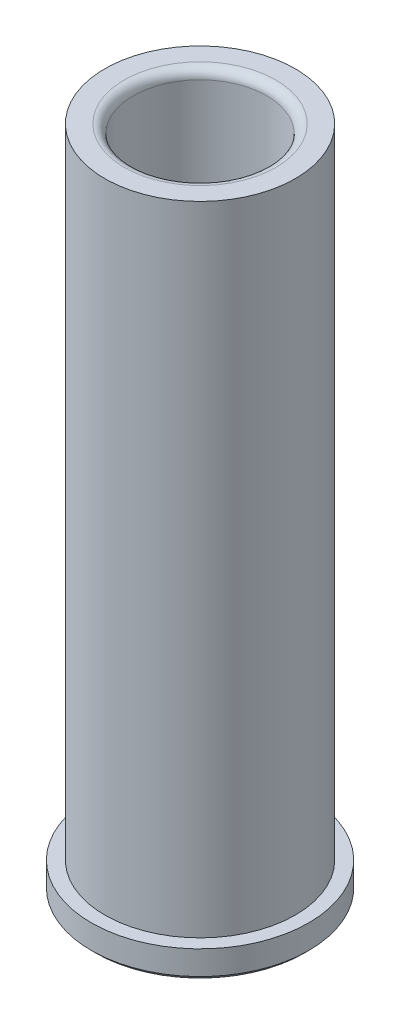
ISO-10303-21;
HEADER;
FILE_DESCRIPTION(('STEP AP214'),'2;1');
FILE_NAME('part.step','',(''),(''),'','','');
FILE_SCHEMA(('AUTOMOTIVE_DESIGN { 1 0 10303 214 1 1 1 1 }'));
ENDSEC;
DATA;
#1=APPLICATION_CONTEXT('core data for automotive mechanical design processes');
#2=APPLICATION_PROTOCOL_DEFINITION('international standard','automotive_design',2000,#1);
#3=PRODUCT_CONTEXT('',#1,'mechanical');
#4=PRODUCT('Part','Part','',(#3));
#5=PRODUCT_RELATED_PRODUCT_CATEGORY('part','',(#4));
#6=PRODUCT_DEFINITION_FORMATION('','',#4);
#7=PRODUCT_DEFINITION_CONTEXT('part definition',#1,'design');
#8=PRODUCT_DEFINITION('design','',#6,#7);
#9=PRODUCT_DEFINITION_SHAPE('','',#8);
#10=(LENGTH_UNIT() NAMED_UNIT(*) SI_UNIT(.MILLI.,.METRE.));
#11=(NAMED_UNIT(*) PLANE_ANGLE_UNIT() SI_UNIT($,.RADIAN.));
#12=(NAMED_UNIT(*) SI_UNIT($,.STERADIAN.) SOLID_ANGLE_UNIT());
#13=UNCERTAINTY_MEASURE_WITH_UNIT(LENGTH_MEASURE(1.E-05),#10,'distance_accuracy_value','');
#14=(GEOMETRIC_REPRESENTATION_CONTEXT(3) GLOBAL_UNCERTAINTY_ASSIGNED_CONTEXT((#13)) GLOBAL_UNIT_ASSIGNED_CONTEXT((#10,
#11,#12)) REPRESENTATION_CONTEXT('',''));
#15=CARTESIAN_POINT('',(0.,0.,0.));
#16=DIRECTION('',(0.,0.,1.));
#17=DIRECTION('',(1.,0.,0.));
#18=AXIS2_PLACEMENT_3D('',#15,#16,#17);
#19=CARTESIAN_POINT('',(3.49148336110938E-12,-1000.,0.));
#20=DIRECTION('',(0.,-1.,0.));
#21=DIRECTION('',(1.,0.,0.));
#22=AXIS2_PLACEMENT_3D('',#19,#20,#21);
#23=CYLINDRICAL_SURFACE('',#22,15.8813499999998);
#24=CARTESIAN_POINT('',(0.,4.7625,0.));
#25=DIRECTION('',(0.,-1.,0.));
#26=DIRECTION('',(1.,0.,0.));
#27=AXIS2_PLACEMENT_3D('',#24,#25,#26);
#28=CIRCLE('',#27,15.88135);
#29=CARTESIAN_POINT('',(15.8813499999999,4.76250000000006,0.));
#30=VERTEX_POINT('',#29);
#31=EDGE_CURVE('E60',#30,#30,#28,.T.);
#32=ORIENTED_EDGE('',*,*,#31,.F.);
#33=EDGE_LOOP('',(#32));
#34=FACE_BOUND('',#33,.T.);
#35=CARTESIAN_POINT('',(-3.8799108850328E-13,111.125,0.));
#36=DIRECTION('',(0.,-1.,0.));
#37=DIRECTION('',(1.,0.,0.));
#38=AXIS2_PLACEMENT_3D('',#35,#36,#37);
#39=CIRCLE('',#38,15.8813499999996);
#40=CARTESIAN_POINT('',(15.8813499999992,111.125,0.));
#41=VERTEX_POINT('',#40);
#42=EDGE_CURVE('E39',#41,#41,#39,.T.);
#43=ORIENTED_EDGE('',*,*,#42,.T.);
#44=EDGE_LOOP('',(#43));
#45=FACE_BOUND('',#44,.T.);
#46=ADVANCED_FACE('F28',(#34,#45),#23,.T.);
#47=CARTESIAN_POINT('',(-15.88135,111.125,0.));
#48=DIRECTION('',(0.,-1.,0.));
#49=DIRECTION('',(1.,0.,0.));
#50=AXIS2_PLACEMENT_3D('',#47,#48,#49);
#51=PLANE('',#50);
#52=CARTESIAN_POINT('',(-3.8799108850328E-13,111.125,0.));
#53=DIRECTION('',(0.,-1.,0.));
#54=DIRECTION('',(1.,0.,0.));
#55=AXIS2_PLACEMENT_3D('',#52,#53,#54);
#56=CIRCLE('',#55,12.6428499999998);
#57=CARTESIAN_POINT('',(12.6428499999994,111.125,0.));
#58=VERTEX_POINT('',#57);
#59=EDGE_CURVE('E35',#58,#58,#56,.T.);
#60=ORIENTED_EDGE('',*,*,#59,.T.);
#61=EDGE_LOOP('',(#60));
#62=FACE_BOUND('',#61,.T.);
#63=ORIENTED_EDGE('',*,*,#42,.F.);
#64=EDGE_LOOP('',(#63));
#65=FACE_BOUND('',#64,.T.);
#66=ADVANCED_FACE('F68',(#62,#65),#51,.F.);
#67=CARTESIAN_POINT('',(3.49148336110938E-12,-1000.,0.));
#68=DIRECTION('',(0.,-1.,0.));
#69=DIRECTION('',(1.,0.,0.));
#70=AXIS2_PLACEMENT_3D('',#67,#68,#69);
#71=CYLINDRICAL_SURFACE('',#70,11.1188499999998);
#72=CARTESIAN_POINT('',(-3.8267006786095E-13,109.601,0.));
#73=DIRECTION('',(0.,-1.,0.));
#74=DIRECTION('',(1.,0.,0.));
#75=AXIS2_PLACEMENT_3D('',#72,#73,#74);
#76=CIRCLE('',#75,11.1188499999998);
#77=CARTESIAN_POINT('',(11.1188499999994,109.601,0.));
#78=VERTEX_POINT('',#77);
#79=EDGE_CURVE('E10',#78,#78,#76,.F.);
#80=ORIENTED_EDGE('',*,*,#79,.T.);
#81=EDGE_LOOP('',(#80));
#82=FACE_BOUND('',#81,.T.);
#83=CARTESIAN_POINT('',(0.,0.761999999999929,0.));
#84=DIRECTION('',(0.,-1.,0.));
#85=DIRECTION('',(1.,0.,0.));
#86=AXIS2_PLACEMENT_3D('',#83,#84,#85);
#87=CIRCLE('',#86,11.11885);
#88=CARTESIAN_POINT('',(11.11885,0.761999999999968,0.));
#89=VERTEX_POINT('',#88);
#90=EDGE_CURVE('E43',#89,#89,#87,.T.);
#91=ORIENTED_EDGE('',*,*,#90,.T.);
#92=EDGE_LOOP('',(#91));
#93=FACE_BOUND('',#92,.T.);
#94=ADVANCED_FACE('F72',(#82,#93),#71,.F.);
#95=CARTESIAN_POINT('',(0.,0.,0.));
#96=DIRECTION('',(0.,-1.,0.));
#97=DIRECTION('',(1.,0.,0.));
#98=AXIS2_PLACEMENT_3D('',#95,#96,#97);
#99=CONICAL_SURFACE('',#98,11.88085,0.785398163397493);
#100=ORIENTED_EDGE('',*,*,#90,.F.);
#101=EDGE_LOOP('',(#100));
#102=FACE_BOUND('',#101,.T.);
#103=CARTESIAN_POINT('',(0.,0.,0.));
#104=DIRECTION('',(0.,-1.,0.));
#105=DIRECTION('',(1.,0.,0.));
#106=AXIS2_PLACEMENT_3D('',#103,#104,#105);
#107=CIRCLE('',#106,11.88085);
#108=CARTESIAN_POINT('',(11.88085,0.,0.));
#109=VERTEX_POINT('',#108);
#110=EDGE_CURVE('E48',#109,#109,#107,.T.);
#111=ORIENTED_EDGE('',*,*,#110,.T.);
#112=EDGE_LOOP('',(#111));
#113=FACE_BOUND('',#112,.T.);
#114=ADVANCED_FACE('F77',(#102,#113),#99,.F.);
#115=CARTESIAN_POINT('',(-11.88085,0.,0.));
#116=DIRECTION('',(0.,1.,0.));
#117=DIRECTION('',(-1.,0.,0.));
#118=AXIS2_PLACEMENT_3D('',#115,#116,#117);
#119=PLANE('',#118);
#120=ORIENTED_EDGE('',*,*,#110,.F.);
#121=EDGE_LOOP('',(#120));
#122=FACE_BOUND('',#121,.T.);
#123=CARTESIAN_POINT('',(0.,0.,0.));
#124=DIRECTION('',(0.,-1.,0.));
#125=DIRECTION('',(1.,0.,0.));
#126=AXIS2_PLACEMENT_3D('',#123,#124,#125);
#127=CIRCLE('',#126,17.3609);
#128=CARTESIAN_POINT('',(17.3609,0.,0.));
#129=VERTEX_POINT('',#128);
#130=EDGE_CURVE('E51',#129,#129,#127,.T.);
#131=ORIENTED_EDGE('',*,*,#130,.T.);
#132=EDGE_LOOP('',(#131));
#133=FACE_BOUND('',#132,.T.);
#134=ADVANCED_FACE('F82',(#122,#133),#119,.F.);
#135=CARTESIAN_POINT('',(0.,0.761999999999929,0.));
#136=DIRECTION('',(0.,1.,0.));
#137=DIRECTION('',(-1.,0.,0.));
#138=AXIS2_PLACEMENT_3D('',#135,#136,#137);
#139=CONICAL_SURFACE('',#138,18.1229,0.785398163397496);
#140=ORIENTED_EDGE('',*,*,#130,.F.);
#141=EDGE_LOOP('',(#140));
#142=FACE_BOUND('',#141,.T.);
#143=CARTESIAN_POINT('',(0.,0.761999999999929,0.));
#144=DIRECTION('',(0.,-1.,0.));
#145=DIRECTION('',(1.,0.,0.));
#146=AXIS2_PLACEMENT_3D('',#143,#144,#145);
#147=CIRCLE('',#146,18.1229);
#148=CARTESIAN_POINT('',(18.1229,0.761999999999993,0.));
#149=VERTEX_POINT('',#148);
#150=EDGE_CURVE('E54',#149,#149,#147,.T.);
#151=ORIENTED_EDGE('',*,*,#150,.T.);
#152=EDGE_LOOP('',(#151));
#153=FACE_BOUND('',#152,.T.);
#154=ADVANCED_FACE('F86',(#142,#153),#139,.T.);
#155=CARTESIAN_POINT('',(3.49148336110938E-12,-1000.,0.));
#156=DIRECTION('',(0.,-1.,0.));
#157=DIRECTION('',(1.,0.,0.));
#158=AXIS2_PLACEMENT_3D('',#155,#156,#157);
#159=CYLINDRICAL_SURFACE('',#158,18.1229);
#160=ORIENTED_EDGE('',*,*,#150,.F.);
#161=EDGE_LOOP('',(#160));
#162=FACE_BOUND('',#161,.T.);
#163=CARTESIAN_POINT('',(0.,4.7625,0.));
#164=DIRECTION('',(0.,-1.,0.));
#165=DIRECTION('',(1.,0.,0.));
#166=AXIS2_PLACEMENT_3D('',#163,#164,#165);
#167=CIRCLE('',#166,18.1229);
#168=CARTESIAN_POINT('',(18.1229,4.76250000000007,0.));
#169=VERTEX_POINT('',#168);
#170=EDGE_CURVE('E57',#169,#169,#167,.T.);
#171=ORIENTED_EDGE('',*,*,#170,.T.);
#172=EDGE_LOOP('',(#171));
#173=FACE_BOUND('',#172,.T.);
#174=ADVANCED_FACE('F90',(#162,#173),#159,.T.);
#175=CARTESIAN_POINT('',(-18.1229,4.76249999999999,0.));
#176=DIRECTION('',(0.,-1.,0.));
#177=DIRECTION('',(1.,0.,0.));
#178=AXIS2_PLACEMENT_3D('',#175,#176,#177);
#179=PLANE('',#178);
#180=ORIENTED_EDGE('',*,*,#170,.F.);
#181=EDGE_LOOP('',(#180));
#182=FACE_BOUND('',#181,.T.);
#183=ORIENTED_EDGE('',*,*,#31,.T.);
#184=EDGE_LOOP('',(#183));
#185=FACE_BOUND('',#184,.T.);
#186=ADVANCED_FACE('F64',(#182,#185),#179,.F.);
#187=CARTESIAN_POINT('',(-3.8267006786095E-13,109.601,0.));
#188=DIRECTION('',(0.,-1.,0.));
#189=DIRECTION('',(1.,0.,0.));
#190=AXIS2_PLACEMENT_3D('',#187,#188,#189);
#191=TOROIDAL_SURFACE('',#190,12.6428499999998,1.524);
#192=ORIENTED_EDGE('',*,*,#79,.F.);
#193=EDGE_LOOP('',(#192));
#194=FACE_BOUND('',#193,.T.);
#195=ORIENTED_EDGE('',*,*,#59,.F.);
#196=EDGE_LOOP('',(#195));
#197=FACE_BOUND('',#196,.T.);
#198=ADVANCED_FACE('F30',(#194,#197),#191,.T.);
#199=CLOSED_SHELL('',(#46,#66,#94,#114,#134,#154,#174,#186,#198));
#200=MANIFOLD_SOLID_BREP('B2',#199);
#201=ADVANCED_BREP_SHAPE_REPRESENTATION('',(#18,#200),#14);
#202=SHAPE_DEFINITION_REPRESENTATION(#9,#201);
ENDSEC;
END-ISO-10303-21;
